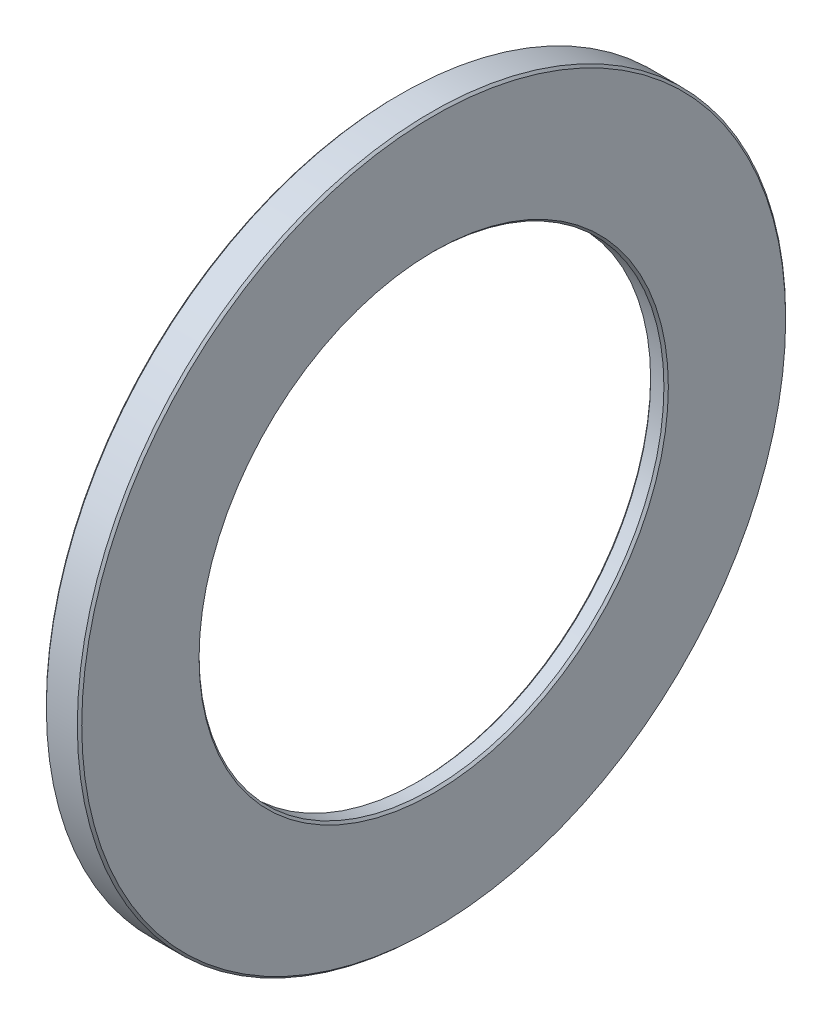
ISO-10303-21;
HEADER;
FILE_DESCRIPTION(('STEP AP214'),'2;1');
FILE_NAME('part.step','',(''),(''),'','','');
FILE_SCHEMA(('AUTOMOTIVE_DESIGN { 1 0 10303 214 1 1 1 1 }'));
ENDSEC;
DATA;
#1=APPLICATION_CONTEXT('core data for automotive mechanical design processes');
#2=APPLICATION_PROTOCOL_DEFINITION('international standard','automotive_design',2000,#1);
#3=PRODUCT_CONTEXT('',#1,'mechanical');
#4=PRODUCT('Part','Part','',(#3));
#5=PRODUCT_RELATED_PRODUCT_CATEGORY('part','',(#4));
#6=PRODUCT_DEFINITION_FORMATION('','',#4);
#7=PRODUCT_DEFINITION_CONTEXT('part definition',#1,'design');
#8=PRODUCT_DEFINITION('design','',#6,#7);
#9=PRODUCT_DEFINITION_SHAPE('','',#8);
#10=(LENGTH_UNIT() NAMED_UNIT(*) SI_UNIT(.MILLI.,.METRE.));
#11=(NAMED_UNIT(*) PLANE_ANGLE_UNIT() SI_UNIT($,.RADIAN.));
#12=(NAMED_UNIT(*) SI_UNIT($,.STERADIAN.) SOLID_ANGLE_UNIT());
#13=UNCERTAINTY_MEASURE_WITH_UNIT(LENGTH_MEASURE(1.E-05),#10,'distance_accuracy_value','');
#14=(GEOMETRIC_REPRESENTATION_CONTEXT(3) GLOBAL_UNCERTAINTY_ASSIGNED_CONTEXT((#13)) GLOBAL_UNIT_ASSIGNED_CONTEXT((#10,
#11,#12)) REPRESENTATION_CONTEXT('',''));
#15=CARTESIAN_POINT('',(0.,0.,0.));
#16=DIRECTION('',(0.,0.,1.));
#17=DIRECTION('',(1.,0.,0.));
#18=AXIS2_PLACEMENT_3D('',#15,#16,#17);
#19=CARTESIAN_POINT('',(0.,0.,0.));
#20=DIRECTION('',(-1.,0.,0.));
#21=DIRECTION('',(0.,0.,1.));
#22=AXIS2_PLACEMENT_3D('',#19,#20,#21);
#23=CYLINDRICAL_SURFACE('',#22,80.);
#24=CARTESIAN_POINT('',(7.50000000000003,0.,0.));
#25=DIRECTION('',(-1.,0.,0.));
#26=DIRECTION('',(0.,0.,1.));
#27=AXIS2_PLACEMENT_3D('',#24,#25,#26);
#28=CIRCLE('',#27,80.);
#29=CARTESIAN_POINT('',(7.50000000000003,0.,80.));
#30=VERTEX_POINT('',#29);
#31=EDGE_CURVE('E48',#30,#30,#28,.T.);
#32=ORIENTED_EDGE('',*,*,#31,.T.);
#33=EDGE_LOOP('',(#32));
#34=FACE_BOUND('',#33,.T.);
#35=CARTESIAN_POINT('',(0.500000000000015,0.,0.));
#36=DIRECTION('',(1.,0.,0.));
#37=DIRECTION('',(0.,0.,-1.));
#38=AXIS2_PLACEMENT_3D('',#35,#36,#37);
#39=CIRCLE('',#38,80.);
#40=CARTESIAN_POINT('',(0.500000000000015,0.,-80.));
#41=VERTEX_POINT('',#40);
#42=EDGE_CURVE('E51',#41,#41,#39,.T.);
#43=ORIENTED_EDGE('',*,*,#42,.T.);
#44=EDGE_LOOP('',(#43));
#45=FACE_BOUND('',#44,.T.);
#46=ADVANCED_FACE('F29',(#34,#45),#23,.T.);
#47=CARTESIAN_POINT('',(8.,52.5,0.));
#48=DIRECTION('',(-1.,0.,0.));
#49=DIRECTION('',(0.,0.,1.));
#50=AXIS2_PLACEMENT_3D('',#47,#48,#49);
#51=PLANE('',#50);
#52=CARTESIAN_POINT('',(8.,0.,0.));
#53=DIRECTION('',(-1.,0.,0.));
#54=DIRECTION('',(0.,0.,1.));
#55=AXIS2_PLACEMENT_3D('',#52,#53,#54);
#56=CIRCLE('',#55,53.);
#57=CARTESIAN_POINT('',(8.,0.,53.));
#58=VERTEX_POINT('',#57);
#59=EDGE_CURVE('E60',#58,#58,#56,.T.);
#60=ORIENTED_EDGE('',*,*,#59,.T.);
#61=EDGE_LOOP('',(#60));
#62=FACE_BOUND('',#61,.T.);
#63=CARTESIAN_POINT('',(8.,0.,0.));
#64=DIRECTION('',(-1.,0.,0.));
#65=DIRECTION('',(0.,0.,1.));
#66=AXIS2_PLACEMENT_3D('',#63,#64,#65);
#67=CIRCLE('',#66,79.5);
#68=CARTESIAN_POINT('',(8.,0.,79.5));
#69=VERTEX_POINT('',#68);
#70=EDGE_CURVE('E63',#69,#69,#67,.F.);
#71=ORIENTED_EDGE('',*,*,#70,.T.);
#72=EDGE_LOOP('',(#71));
#73=FACE_BOUND('',#72,.T.);
#74=ADVANCED_FACE('F87',(#62,#73),#51,.F.);
#75=CARTESIAN_POINT('',(0.,0.,0.));
#76=DIRECTION('',(-1.,0.,0.));
#77=DIRECTION('',(0.,0.,1.));
#78=AXIS2_PLACEMENT_3D('',#75,#76,#77);
#79=CYLINDRICAL_SURFACE('',#78,52.5);
#80=CARTESIAN_POINT('',(7.50000000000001,0.,0.));
#81=DIRECTION('',(-1.,0.,0.));
#82=DIRECTION('',(0.,0.,1.));
#83=AXIS2_PLACEMENT_3D('',#80,#81,#82);
#84=CIRCLE('',#83,52.5);
#85=CARTESIAN_POINT('',(7.50000000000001,0.,52.5));
#86=VERTEX_POINT('',#85);
#87=EDGE_CURVE('E54',#86,#86,#84,.F.);
#88=ORIENTED_EDGE('',*,*,#87,.T.);
#89=EDGE_LOOP('',(#88));
#90=FACE_BOUND('',#89,.T.);
#91=CARTESIAN_POINT('',(4.49999999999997,0.,0.));
#92=DIRECTION('',(1.,0.,0.));
#93=DIRECTION('',(0.,0.,-1.));
#94=AXIS2_PLACEMENT_3D('',#91,#92,#93);
#95=CIRCLE('',#94,52.5);
#96=CARTESIAN_POINT('',(4.49999999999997,0.,-52.5));
#97=VERTEX_POINT('',#96);
#98=EDGE_CURVE('E57',#97,#97,#95,.F.);
#99=ORIENTED_EDGE('',*,*,#98,.T.);
#100=EDGE_LOOP('',(#99));
#101=FACE_BOUND('',#100,.T.);
#102=ADVANCED_FACE('F83',(#90,#101),#79,.F.);
#103=CARTESIAN_POINT('',(4.,72.5,0.));
#104=DIRECTION('',(1.,0.,0.));
#105=DIRECTION('',(0.,0.,-1.));
#106=AXIS2_PLACEMENT_3D('',#103,#104,#105);
#107=PLANE('',#106);
#108=CARTESIAN_POINT('',(4.,0.,0.));
#109=DIRECTION('',(1.,0.,0.));
#110=DIRECTION('',(0.,0.,-1.));
#111=AXIS2_PLACEMENT_3D('',#108,#109,#110);
#112=CIRCLE('',#111,53.);
#113=CARTESIAN_POINT('',(4.,0.,-53.));
#114=VERTEX_POINT('',#113);
#115=EDGE_CURVE('E43',#114,#114,#112,.T.);
#116=ORIENTED_EDGE('',*,*,#115,.T.);
#117=EDGE_LOOP('',(#116));
#118=FACE_BOUND('',#117,.T.);
#119=CARTESIAN_POINT('',(4.,0.,0.));
#120=DIRECTION('',(-1.,0.,0.));
#121=DIRECTION('',(0.,0.,1.));
#122=AXIS2_PLACEMENT_3D('',#119,#120,#121);
#123=CIRCLE('',#122,72.5);
#124=CARTESIAN_POINT('',(4.,0.,72.5));
#125=VERTEX_POINT('',#124);
#126=EDGE_CURVE('E66',#125,#125,#123,.T.);
#127=ORIENTED_EDGE('',*,*,#126,.T.);
#128=EDGE_LOOP('',(#127));
#129=FACE_BOUND('',#128,.T.);
#130=ADVANCED_FACE('F70',(#118,#129),#107,.F.);
#131=CARTESIAN_POINT('',(0.,0.,0.));
#132=DIRECTION('',(-1.,0.,0.));
#133=DIRECTION('',(0.,0.,1.));
#134=AXIS2_PLACEMENT_3D('',#131,#132,#133);
#135=CYLINDRICAL_SURFACE('',#134,72.5);
#136=CARTESIAN_POINT('',(0.500000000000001,0.,0.));
#137=DIRECTION('',(1.,0.,0.));
#138=DIRECTION('',(0.,0.,-1.));
#139=AXIS2_PLACEMENT_3D('',#136,#137,#138);
#140=CIRCLE('',#139,72.5);
#141=CARTESIAN_POINT('',(0.500000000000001,0.,-72.5));
#142=VERTEX_POINT('',#141);
#143=EDGE_CURVE('E39',#142,#142,#140,.F.);
#144=ORIENTED_EDGE('',*,*,#143,.T.);
#145=EDGE_LOOP('',(#144));
#146=FACE_BOUND('',#145,.T.);
#147=ORIENTED_EDGE('',*,*,#126,.F.);
#148=EDGE_LOOP('',(#147));
#149=FACE_BOUND('',#148,.T.);
#150=ADVANCED_FACE('F72',(#146,#149),#135,.F.);
#151=CARTESIAN_POINT('',(0.,80.,0.));
#152=DIRECTION('',(1.,0.,0.));
#153=DIRECTION('',(0.,0.,-1.));
#154=AXIS2_PLACEMENT_3D('',#151,#152,#153);
#155=PLANE('',#154);
#156=CARTESIAN_POINT('',(0.,0.,0.));
#157=DIRECTION('',(1.,0.,0.));
#158=DIRECTION('',(0.,0.,-1.));
#159=AXIS2_PLACEMENT_3D('',#156,#157,#158);
#160=CIRCLE('',#159,73.);
#161=CARTESIAN_POINT('',(0.,0.,-73.));
#162=VERTEX_POINT('',#161);
#163=EDGE_CURVE('E10',#162,#162,#160,.T.);
#164=ORIENTED_EDGE('',*,*,#163,.T.);
#165=EDGE_LOOP('',(#164));
#166=FACE_BOUND('',#165,.T.);
#167=CARTESIAN_POINT('',(0.,0.,0.));
#168=DIRECTION('',(1.,0.,0.));
#169=DIRECTION('',(0.,0.,-1.));
#170=AXIS2_PLACEMENT_3D('',#167,#168,#169);
#171=CIRCLE('',#170,79.5);
#172=CARTESIAN_POINT('',(0.,0.,-79.5));
#173=VERTEX_POINT('',#172);
#174=EDGE_CURVE('E35',#173,#173,#171,.F.);
#175=ORIENTED_EDGE('',*,*,#174,.T.);
#176=EDGE_LOOP('',(#175));
#177=FACE_BOUND('',#176,.T.);
#178=ADVANCED_FACE('F74',(#166,#177),#155,.F.);
#179=CARTESIAN_POINT('',(8.,0.,0.));
#180=DIRECTION('',(1.,0.,0.));
#181=DIRECTION('',(0.,0.,-1.));
#182=AXIS2_PLACEMENT_3D('',#179,#180,#181);
#183=CONICAL_SURFACE('',#182,53.,0.785398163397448);
#184=ORIENTED_EDGE('',*,*,#87,.F.);
#185=EDGE_LOOP('',(#184));
#186=FACE_BOUND('',#185,.T.);
#187=ORIENTED_EDGE('',*,*,#59,.F.);
#188=EDGE_LOOP('',(#187));
#189=FACE_BOUND('',#188,.T.);
#190=ADVANCED_FACE('F81',(#186,#189),#183,.F.);
#191=CARTESIAN_POINT('',(7.50000000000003,0.,0.));
#192=DIRECTION('',(-1.,0.,0.));
#193=DIRECTION('',(0.,0.,1.));
#194=AXIS2_PLACEMENT_3D('',#191,#192,#193);
#195=CONICAL_SURFACE('',#194,80.,0.785398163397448);
#196=ORIENTED_EDGE('',*,*,#70,.F.);
#197=EDGE_LOOP('',(#196));
#198=FACE_BOUND('',#197,.T.);
#199=ORIENTED_EDGE('',*,*,#31,.F.);
#200=EDGE_LOOP('',(#199));
#201=FACE_BOUND('',#200,.T.);
#202=ADVANCED_FACE('F111',(#198,#201),#195,.T.);
#203=CARTESIAN_POINT('',(4.49999999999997,0.,0.));
#204=DIRECTION('',(-1.,0.,0.));
#205=DIRECTION('',(0.,0.,1.));
#206=AXIS2_PLACEMENT_3D('',#203,#204,#205);
#207=CONICAL_SURFACE('',#206,52.5,0.785398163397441);
#208=ORIENTED_EDGE('',*,*,#115,.F.);
#209=EDGE_LOOP('',(#208));
#210=FACE_BOUND('',#209,.T.);
#211=ORIENTED_EDGE('',*,*,#98,.F.);
#212=EDGE_LOOP('',(#211));
#213=FACE_BOUND('',#212,.T.);
#214=ADVANCED_FACE('F105',(#210,#213),#207,.F.);
#215=CARTESIAN_POINT('',(0.500000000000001,0.,0.));
#216=DIRECTION('',(-1.,0.,0.));
#217=DIRECTION('',(0.,0.,1.));
#218=AXIS2_PLACEMENT_3D('',#215,#216,#217);
#219=CONICAL_SURFACE('',#218,72.5,0.785398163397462);
#220=ORIENTED_EDGE('',*,*,#163,.F.);
#221=EDGE_LOOP('',(#220));
#222=FACE_BOUND('',#221,.T.);
#223=ORIENTED_EDGE('',*,*,#143,.F.);
#224=EDGE_LOOP('',(#223));
#225=FACE_BOUND('',#224,.T.);
#226=ADVANCED_FACE('F100',(#222,#225),#219,.F.);
#227=CARTESIAN_POINT('',(0.,0.,0.));
#228=DIRECTION('',(1.,0.,0.));
#229=DIRECTION('',(0.,0.,-1.));
#230=AXIS2_PLACEMENT_3D('',#227,#228,#229);
#231=CONICAL_SURFACE('',#230,79.5,0.785398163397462);
#232=ORIENTED_EDGE('',*,*,#42,.F.);
#233=EDGE_LOOP('',(#232));
#234=FACE_BOUND('',#233,.T.);
#235=ORIENTED_EDGE('',*,*,#174,.F.);
#236=EDGE_LOOP('',(#235));
#237=FACE_BOUND('',#236,.T.);
#238=ADVANCED_FACE('F97',(#234,#237),#231,.T.);
#239=CLOSED_SHELL('',(#46,#74,#102,#130,#150,#178,#190,#202,#214,#226,#238));
#240=MANIFOLD_SOLID_BREP('B2',#239);
#241=ADVANCED_BREP_SHAPE_REPRESENTATION('',(#18,#240),#14);
#242=SHAPE_DEFINITION_REPRESENTATION(#9,#241);
ENDSEC;
END-ISO-10303-21;
